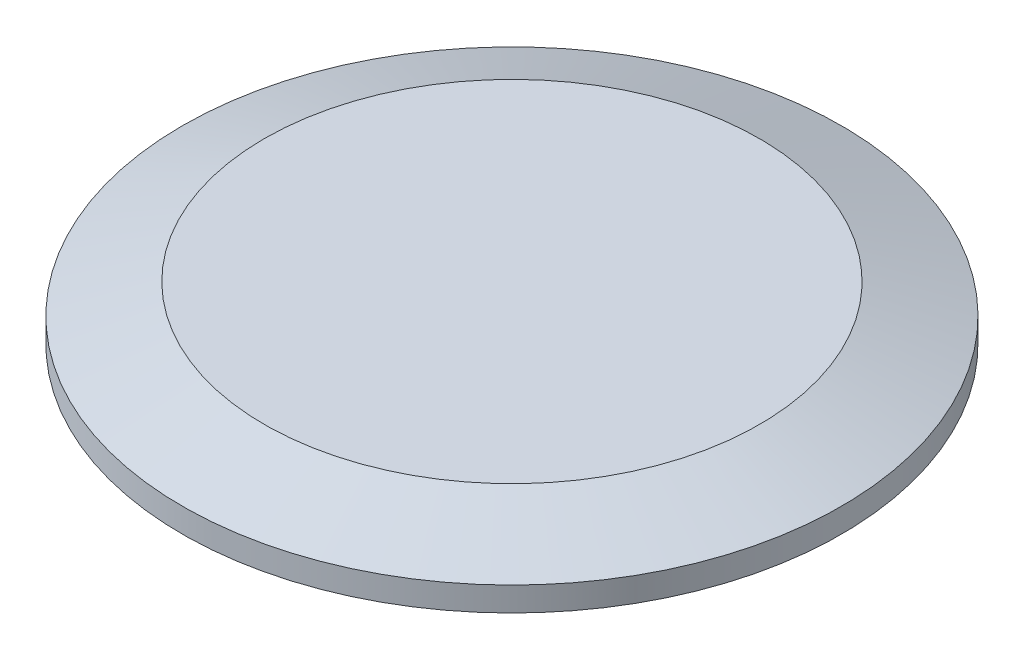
ISO-10303-21;
HEADER;
FILE_DESCRIPTION(('STEP AP214'),'2;1');
FILE_NAME('part.step','',(''),(''),'','','');
FILE_SCHEMA(('AUTOMOTIVE_DESIGN { 1 0 10303 214 1 1 1 1 }'));
ENDSEC;
DATA;
#1=APPLICATION_CONTEXT('core data for automotive mechanical design processes');
#2=APPLICATION_PROTOCOL_DEFINITION('international standard','automotive_design',2000,#1);
#3=PRODUCT_CONTEXT('',#1,'mechanical');
#4=PRODUCT('Part','Part','',(#3));
#5=PRODUCT_RELATED_PRODUCT_CATEGORY('part','',(#4));
#6=PRODUCT_DEFINITION_FORMATION('','',#4);
#7=PRODUCT_DEFINITION_CONTEXT('part definition',#1,'design');
#8=PRODUCT_DEFINITION('design','',#6,#7);
#9=PRODUCT_DEFINITION_SHAPE('','',#8);
#10=(LENGTH_UNIT() NAMED_UNIT(*) SI_UNIT(.MILLI.,.METRE.));
#11=(NAMED_UNIT(*) PLANE_ANGLE_UNIT() SI_UNIT($,.RADIAN.));
#12=(NAMED_UNIT(*) SI_UNIT($,.STERADIAN.) SOLID_ANGLE_UNIT());
#13=UNCERTAINTY_MEASURE_WITH_UNIT(LENGTH_MEASURE(1.E-05),#10,'distance_accuracy_value','');
#14=(GEOMETRIC_REPRESENTATION_CONTEXT(3) GLOBAL_UNCERTAINTY_ASSIGNED_CONTEXT((#13)) GLOBAL_UNIT_ASSIGNED_CONTEXT((#10,
#11,#12)) REPRESENTATION_CONTEXT('',''));
#15=CARTESIAN_POINT('',(0.,0.,0.));
#16=DIRECTION('',(0.,0.,1.));
#17=DIRECTION('',(1.,0.,0.));
#18=AXIS2_PLACEMENT_3D('',#15,#16,#17);
#19=CARTESIAN_POINT('',(-29.0918421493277,6.35,0.));
#20=DIRECTION('',(0.,1.,0.));
#21=DIRECTION('',(-1.,0.,0.));
#22=AXIS2_PLACEMENT_3D('',#19,#20,#21);
#23=PLANE('',#22);
#24=CARTESIAN_POINT('',(0.,6.35,0.));
#25=DIRECTION('',(0.,1.,0.));
#26=DIRECTION('',(-1.,0.,0.));
#27=AXIS2_PLACEMENT_3D('',#24,#25,#26);
#28=CIRCLE('',#27,29.0918421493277);
#29=CARTESIAN_POINT('',(-29.0918421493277,6.35,0.));
#30=VERTEX_POINT('',#29);
#31=EDGE_CURVE('E10',#30,#30,#28,.T.);
#32=ORIENTED_EDGE('',*,*,#31,.T.);
#33=EDGE_LOOP('',(#32));
#34=FACE_BOUND('',#33,.T.);
#35=ADVANCED_FACE('F31',(#34),#23,.T.);
#36=CARTESIAN_POINT('',(0.,6.35,0.));
#37=DIRECTION('',(0.,-1.,0.));
#38=DIRECTION('',(1.,0.,0.));
#39=AXIS2_PLACEMENT_3D('',#36,#37,#38);
#40=CONICAL_SURFACE('',#39,29.0918421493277,1.22173047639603);
#41=CARTESIAN_POINT('',(0.,2.8448,0.));
#42=DIRECTION('',(0.,1.,0.));
#43=DIRECTION('',(-1.,0.,0.));
#44=AXIS2_PLACEMENT_3D('',#41,#42,#43);
#45=CIRCLE('',#44,38.7223);
#46=CARTESIAN_POINT('',(-38.7223,2.8448,0.));
#47=VERTEX_POINT('',#46);
#48=EDGE_CURVE('E37',#47,#47,#45,.T.);
#49=ORIENTED_EDGE('',*,*,#48,.T.);
#50=EDGE_LOOP('',(#49));
#51=FACE_BOUND('',#50,.T.);
#52=ORIENTED_EDGE('',*,*,#31,.F.);
#53=EDGE_LOOP('',(#52));
#54=FACE_BOUND('',#53,.T.);
#55=ADVANCED_FACE('F72',(#51,#54),#40,.T.);
#56=CARTESIAN_POINT('',(0.,6.35,0.));
#57=DIRECTION('',(0.,1.,0.));
#58=DIRECTION('',(-1.,0.,0.));
#59=AXIS2_PLACEMENT_3D('',#56,#57,#58);
#60=CYLINDRICAL_SURFACE('',#59,38.7223);
#61=CARTESIAN_POINT('',(0.,0.,0.));
#62=DIRECTION('',(0.,1.,0.));
#63=DIRECTION('',(-1.,0.,0.));
#64=AXIS2_PLACEMENT_3D('',#61,#62,#63);
#65=CIRCLE('',#64,38.7223);
#66=CARTESIAN_POINT('',(-38.7223,0.,0.));
#67=VERTEX_POINT('',#66);
#68=EDGE_CURVE('E41',#67,#67,#65,.T.);
#69=ORIENTED_EDGE('',*,*,#68,.T.);
#70=EDGE_LOOP('',(#69));
#71=FACE_BOUND('',#70,.T.);
#72=ORIENTED_EDGE('',*,*,#48,.F.);
#73=EDGE_LOOP('',(#72));
#74=FACE_BOUND('',#73,.T.);
#75=ADVANCED_FACE('F76',(#71,#74),#60,.T.);
#76=CARTESIAN_POINT('',(-37.1367084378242,0.,0.));
#77=DIRECTION('',(0.,-1.,0.));
#78=DIRECTION('',(1.,0.,0.));
#79=AXIS2_PLACEMENT_3D('',#76,#77,#78);
#80=PLANE('',#79);
#81=CARTESIAN_POINT('',(0.,0.,0.));
#82=DIRECTION('',(0.,1.,0.));
#83=DIRECTION('',(-1.,0.,0.));
#84=AXIS2_PLACEMENT_3D('',#81,#82,#83);
#85=CIRCLE('',#84,37.1367084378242);
#86=CARTESIAN_POINT('',(-37.1367084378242,0.,0.));
#87=VERTEX_POINT('',#86);
#88=EDGE_CURVE('E45',#87,#87,#85,.T.);
#89=ORIENTED_EDGE('',*,*,#88,.T.);
#90=EDGE_LOOP('',(#89));
#91=FACE_BOUND('',#90,.T.);
#92=ORIENTED_EDGE('',*,*,#68,.F.);
#93=EDGE_LOOP('',(#92));
#94=FACE_BOUND('',#93,.T.);
#95=ADVANCED_FACE('F80',(#91,#94),#80,.T.);
#96=CARTESIAN_POINT('',(0.,0.787399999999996,0.));
#97=DIRECTION('',(0.,1.,0.));
#98=DIRECTION('',(-1.,0.,0.));
#99=AXIS2_PLACEMENT_3D('',#96,#97,#98);
#100=TOROIDAL_SURFACE('',#99,37.1367084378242,0.787399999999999);
#101=CARTESIAN_POINT('',(0.,0.47445897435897,0.));
#102=DIRECTION('',(0.,1.,0.));
#103=DIRECTION('',(-1.,0.,0.));
#104=AXIS2_PLACEMENT_3D('',#101,#102,#103);
#105=CIRCLE('',#104,36.4141666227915);
#106=CARTESIAN_POINT('',(-36.4141666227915,0.474458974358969,0.));
#107=VERTEX_POINT('',#106);
#108=EDGE_CURVE('E50',#107,#107,#105,.T.);
#109=ORIENTED_EDGE('',*,*,#108,.T.);
#110=EDGE_LOOP('',(#109));
#111=FACE_BOUND('',#110,.T.);
#112=ORIENTED_EDGE('',*,*,#88,.F.);
#113=EDGE_LOOP('',(#112));
#114=FACE_BOUND('',#113,.T.);
#115=ADVANCED_FACE('F87',(#111,#114),#100,.T.);
#116=CARTESIAN_POINT('',(0.,0.,0.));
#117=DIRECTION('',(0.,1.,0.));
#118=DIRECTION('',(-1.,0.,0.));
#119=AXIS2_PLACEMENT_3D('',#116,#117,#118);
#120=TOROIDAL_SURFACE('',#119,35.3187,1.1938);
#121=CARTESIAN_POINT('',(0.,0.474458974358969,0.));
#122=DIRECTION('',(0.,1.,0.));
#123=DIRECTION('',(-1.,0.,0.));
#124=AXIS2_PLACEMENT_3D('',#121,#122,#123);
#125=CIRCLE('',#124,34.2232333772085);
#126=CARTESIAN_POINT('',(-34.2232333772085,0.474458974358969,0.));
#127=VERTEX_POINT('',#126);
#128=EDGE_CURVE('E53',#127,#127,#125,.T.);
#129=ORIENTED_EDGE('',*,*,#128,.T.);
#130=EDGE_LOOP('',(#129));
#131=FACE_BOUND('',#130,.T.);
#132=ORIENTED_EDGE('',*,*,#108,.F.);
#133=EDGE_LOOP('',(#132));
#134=FACE_BOUND('',#133,.T.);
#135=ADVANCED_FACE('F69',(#131,#134),#120,.F.);
#136=CARTESIAN_POINT('',(0.,0.787399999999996,0.));
#137=DIRECTION('',(0.,1.,0.));
#138=DIRECTION('',(-1.,0.,0.));
#139=AXIS2_PLACEMENT_3D('',#136,#137,#138);
#140=TOROIDAL_SURFACE('',#139,33.5006915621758,0.787399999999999);
#141=CARTESIAN_POINT('',(0.,0.,0.));
#142=DIRECTION('',(0.,1.,0.));
#143=DIRECTION('',(-1.,0.,0.));
#144=AXIS2_PLACEMENT_3D('',#141,#142,#143);
#145=CIRCLE('',#144,33.5006915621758);
#146=CARTESIAN_POINT('',(-33.5006915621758,0.,0.));
#147=VERTEX_POINT('',#146);
#148=EDGE_CURVE('E56',#147,#147,#145,.T.);
#149=ORIENTED_EDGE('',*,*,#148,.T.);
#150=EDGE_LOOP('',(#149));
#151=FACE_BOUND('',#150,.T.);
#152=ORIENTED_EDGE('',*,*,#128,.F.);
#153=EDGE_LOOP('',(#152));
#154=FACE_BOUND('',#153,.T.);
#155=ADVANCED_FACE('F60',(#151,#154),#140,.T.);
#156=CARTESIAN_POINT('',(0.,0.,0.));
#157=DIRECTION('',(0.,-1.,0.));
#158=DIRECTION('',(1.,0.,0.));
#159=AXIS2_PLACEMENT_3D('',#156,#157,#158);
#160=PLANE('',#159);
#161=ORIENTED_EDGE('',*,*,#148,.F.);
#162=EDGE_LOOP('',(#161));
#163=FACE_BOUND('',#162,.T.);
#164=ADVANCED_FACE('F63',(#163),#160,.T.);
#165=CLOSED_SHELL('',(#35,#55,#75,#95,#115,#135,#155,#164));
#166=MANIFOLD_SOLID_BREP('B2',#165);
#167=ADVANCED_BREP_SHAPE_REPRESENTATION('',(#18,#166),#14);
#168=SHAPE_DEFINITION_REPRESENTATION(#9,#167);
ENDSEC;
END-ISO-10303-21;
